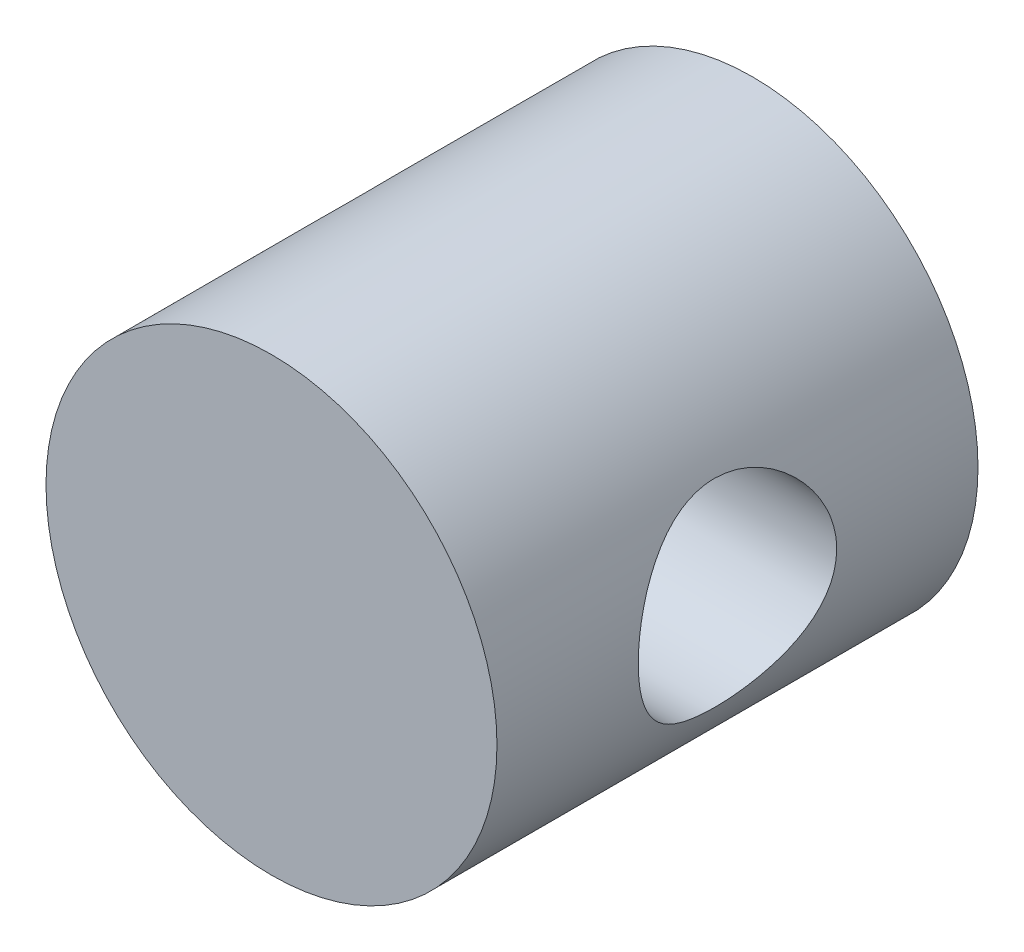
ISO-10303-21;
HEADER;
FILE_DESCRIPTION(('STEP AP214'),'2;1');
FILE_NAME('part.step','',(''),(''),'','','');
FILE_SCHEMA(('AUTOMOTIVE_DESIGN { 1 0 10303 214 1 1 1 1 }'));
ENDSEC;
DATA;
#1=APPLICATION_CONTEXT('core data for automotive mechanical design processes');
#2=APPLICATION_PROTOCOL_DEFINITION('international standard','automotive_design',2000,#1);
#3=PRODUCT_CONTEXT('',#1,'mechanical');
#4=PRODUCT('Part','Part','',(#3));
#5=PRODUCT_RELATED_PRODUCT_CATEGORY('part','',(#4));
#6=PRODUCT_DEFINITION_FORMATION('','',#4);
#7=PRODUCT_DEFINITION_CONTEXT('part definition',#1,'design');
#8=PRODUCT_DEFINITION('design','',#6,#7);
#9=PRODUCT_DEFINITION_SHAPE('','',#8);
#10=(LENGTH_UNIT() NAMED_UNIT(*) SI_UNIT(.MILLI.,.METRE.));
#11=(NAMED_UNIT(*) PLANE_ANGLE_UNIT() SI_UNIT($,.RADIAN.));
#12=(NAMED_UNIT(*) SI_UNIT($,.STERADIAN.) SOLID_ANGLE_UNIT());
#13=UNCERTAINTY_MEASURE_WITH_UNIT(LENGTH_MEASURE(1.E-05),#10,'distance_accuracy_value','');
#14=(GEOMETRIC_REPRESENTATION_CONTEXT(3) GLOBAL_UNCERTAINTY_ASSIGNED_CONTEXT((#13)) GLOBAL_UNIT_ASSIGNED_CONTEXT((#10,
#11,#12)) REPRESENTATION_CONTEXT('',''));
#15=CARTESIAN_POINT('',(0.,0.,0.));
#16=DIRECTION('',(0.,0.,1.));
#17=DIRECTION('',(1.,0.,0.));
#18=AXIS2_PLACEMENT_3D('',#15,#16,#17);
#19=CARTESIAN_POINT('',(-0.8,0.,8.));
#20=DIRECTION('',(-1.,0.,0.));
#21=DIRECTION('',(0.,0.,1.));
#22=AXIS2_PLACEMENT_3D('',#19,#20,#21);
#23=PLANE('',#22);
#24=CARTESIAN_POINT('',(-0.8,0.,8.));
#25=DIRECTION('',(1.,0.,0.));
#26=DIRECTION('',(0.,0.,-1.));
#27=AXIS2_PLACEMENT_3D('',#24,#25,#26);
#28=CIRCLE('',#27,3.3);
#29=CARTESIAN_POINT('',(-0.8,0.,4.7));
#30=VERTEX_POINT('',#29);
#31=EDGE_CURVE('E20',#30,#30,#28,.T.);
#32=ORIENTED_EDGE('',*,*,#31,.T.);
#33=EDGE_LOOP('',(#32));
#34=FACE_BOUND('',#33,.T.);
#35=CARTESIAN_POINT('',(-0.8,0.,8.));
#36=DIRECTION('',(1.,0.,0.));
#37=DIRECTION('',(0.,0.,-1.));
#38=AXIS2_PLACEMENT_3D('',#35,#36,#37);
#39=CIRCLE('',#38,5.5);
#40=CARTESIAN_POINT('',(-0.8,0.,2.5));
#41=VERTEX_POINT('',#40);
#42=EDGE_CURVE('E68',#41,#41,#39,.F.);
#43=ORIENTED_EDGE('',*,*,#42,.T.);
#44=EDGE_LOOP('',(#43));
#45=FACE_BOUND('',#44,.T.);
#46=ADVANCED_FACE('F17',(#34,#45),#23,.T.);
#47=CARTESIAN_POINT('',(0.,0.,16.));
#48=DIRECTION('',(0.,0.,-1.));
#49=DIRECTION('',(-1.,0.,0.));
#50=AXIS2_PLACEMENT_3D('',#47,#48,#49);
#51=PLANE('',#50);
#52=CARTESIAN_POINT('',(0.,0.,16.));
#53=DIRECTION('',(0.,0.,1.));
#54=DIRECTION('',(1.,0.,0.));
#55=AXIS2_PLACEMENT_3D('',#52,#53,#54);
#56=CIRCLE('',#55,7.5);
#57=CARTESIAN_POINT('',(7.5,0.,16.));
#58=VERTEX_POINT('',#57);
#59=EDGE_CURVE('E77',#58,#58,#56,.F.);
#60=ORIENTED_EDGE('',*,*,#59,.F.);
#61=EDGE_LOOP('',(#60));
#62=FACE_BOUND('',#61,.T.);
#63=ADVANCED_FACE('F63',(#62),#51,.F.);
#64=CARTESIAN_POINT('',(-0.8,0.,8.));
#65=DIRECTION('',(1.,0.,0.));
#66=DIRECTION('',(0.,0.,-1.));
#67=AXIS2_PLACEMENT_3D('',#64,#65,#66);
#68=CYLINDRICAL_SURFACE('',#67,3.3);
#69=ORIENTED_EDGE('',*,*,#31,.F.);
#70=EDGE_LOOP('',(#69));
#71=FACE_BOUND('',#70,.T.);
#72=CARTESIAN_POINT('',(6.73498329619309,3.3,8.));
#73=CARTESIAN_POINT('',(6.73498440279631,3.29999887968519,7.91248038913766));
#74=CARTESIAN_POINT('',(6.73669708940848,3.29651093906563,7.82493180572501));
#75=CARTESIAN_POINT('',(6.74347981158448,3.28260987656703,7.65050235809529));
#76=CARTESIAN_POINT('',(6.74855187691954,3.27219256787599,7.56362192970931));
#77=CARTESIAN_POINT('',(6.76860529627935,3.23063593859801,7.3046481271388));
#78=CARTESIAN_POINT('',(6.78842323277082,3.18919227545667,7.13445168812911));
#79=CARTESIAN_POINT('',(6.83824112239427,3.08089697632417,6.80497056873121));
#80=CARTESIAN_POINT('',(6.86819625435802,3.01415703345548,6.64564150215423));
#81=CARTESIAN_POINT('',(6.93483535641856,2.85749677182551,6.34044383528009));
#82=CARTESIAN_POINT('',(6.9715182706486,2.76758008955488,6.19457312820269));
#83=CARTESIAN_POINT('',(7.05033258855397,2.56043465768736,5.91025350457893));
#84=CARTESIAN_POINT('',(7.09266177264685,2.44183979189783,5.77285489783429));
#85=CARTESIAN_POINT('',(7.17638236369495,2.18356607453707,5.51910723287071));
#86=CARTESIAN_POINT('',(7.217773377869,2.04387857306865,5.40276685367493));
#87=CARTESIAN_POINT('',(7.29740541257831,1.73892968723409,5.1888655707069));
#88=CARTESIAN_POINT('',(7.33539015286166,1.57274639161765,5.0925148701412));
#89=CARTESIAN_POINT('',(7.40147240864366,1.22455264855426,4.92959937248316));
#90=CARTESIAN_POINT('',(7.42957479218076,1.0425500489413,4.86301990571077));
#91=CARTESIAN_POINT('',(7.4713182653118,0.678932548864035,4.76543234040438));
#92=CARTESIAN_POINT('',(7.48569505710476,0.497891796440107,4.73260624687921));
#93=CARTESIAN_POINT('',(7.50105934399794,0.132340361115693,4.69755300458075));
#94=CARTESIAN_POINT('',(7.50205293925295,-0.0521687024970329,4.69531191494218));
#95=CARTESIAN_POINT('',(7.49095039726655,-0.40608529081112,4.72060475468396));
#96=CARTESIAN_POINT('',(7.47973618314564,-0.575669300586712,4.74613249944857));
#97=CARTESIAN_POINT('',(7.44672166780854,-0.907858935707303,4.8227599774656));
#98=CARTESIAN_POINT('',(7.42492058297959,-1.07046404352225,4.87386160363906));
#99=CARTESIAN_POINT('',(7.3723904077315,-1.38709453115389,5.00074755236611));
#100=CARTESIAN_POINT('',(7.34153003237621,-1.54095092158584,5.07689696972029));
#101=CARTESIAN_POINT('',(7.27383821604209,-1.83410626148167,5.25133178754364));
#102=CARTESIAN_POINT('',(7.23700460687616,-1.97339989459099,5.34962523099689));
#103=CARTESIAN_POINT('',(7.15764040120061,-2.24492990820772,5.57436597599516));
#104=CARTESIAN_POINT('',(7.11488951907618,-2.37578855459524,5.70240218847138));
#105=CARTESIAN_POINT('',(7.03056481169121,-2.61481479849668,5.97858424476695));
#106=CARTESIAN_POINT('',(6.98899155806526,-2.7229715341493,6.12673965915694));
#107=CARTESIAN_POINT('',(6.91004959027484,-2.91765559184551,6.4463990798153));
#108=CARTESIAN_POINT('',(6.87291678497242,-3.00313982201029,6.61860182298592));
#109=CARTESIAN_POINT('',(6.80995713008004,-3.14331942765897,6.97701908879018));
#110=CARTESIAN_POINT('',(6.78412112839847,-3.19803973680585,7.16322212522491));
#111=CARTESIAN_POINT('',(6.7490291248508,-3.2714154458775,7.53051092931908));
#112=CARTESIAN_POINT('',(6.73874129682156,-3.29232248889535,7.71104602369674));
#113=CARTESIAN_POINT('',(6.73295149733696,-3.30415333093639,8.07329965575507));
#114=CARTESIAN_POINT('',(6.73744334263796,-3.29508966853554,8.25501766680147));
#115=CARTESIAN_POINT('',(6.75963124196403,-3.24929651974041,8.60007664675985));
#116=CARTESIAN_POINT('',(6.77631192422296,-3.21469251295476,8.76377386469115));
#117=CARTESIAN_POINT('',(6.81964575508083,-3.1217051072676,9.08286232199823));
#118=CARTESIAN_POINT('',(6.84630142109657,-3.06331570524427,9.23825145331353));
#119=CARTESIAN_POINT('',(6.90801364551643,-2.92156740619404,9.54405492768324));
#120=CARTESIAN_POINT('',(6.94339078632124,-2.83721454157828,9.69394165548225));
#121=CARTESIAN_POINT('',(7.01815092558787,-2.64688547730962,9.97820308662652));
#122=CARTESIAN_POINT('',(7.05753578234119,-2.54089922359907,10.1125705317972));
#123=CARTESIAN_POINT('',(7.14027712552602,-2.29875282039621,10.3749695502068));
#124=CARTESIAN_POINT('',(7.18366320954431,-2.160705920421,10.5012579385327));
#125=CARTESIAN_POINT('',(7.26618934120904,-1.86443522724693,10.7292524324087));
#126=CARTESIAN_POINT('',(7.30532884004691,-1.70620883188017,10.8309553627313));
#127=CARTESIAN_POINT('',(7.37543116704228,-1.3719865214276,11.0072562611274));
#128=CARTESIAN_POINT('',(7.40633073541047,-1.19586670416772,11.0816460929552));
#129=CARTESIAN_POINT('',(7.45597789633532,-0.831886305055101,11.1991355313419));
#130=CARTESIAN_POINT('',(7.47473364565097,-0.644033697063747,11.2422561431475));
#131=CARTESIAN_POINT('',(7.49694491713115,-0.277404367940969,11.2931217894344));
#132=CARTESIAN_POINT('',(7.5014592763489,-0.0990297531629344,11.3033163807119));
#133=CARTESIAN_POINT('',(7.49771025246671,0.256869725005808,11.2947959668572));
#134=CARTESIAN_POINT('',(7.48944959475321,0.434394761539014,11.2760871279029));
#135=CARTESIAN_POINT('',(7.46166482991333,0.775658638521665,11.2120424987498));
#136=CARTESIAN_POINT('',(7.44263870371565,0.939662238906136,11.1678824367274));
#137=CARTESIAN_POINT('',(7.39552410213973,1.25781917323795,11.0555471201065));
#138=CARTESIAN_POINT('',(7.36743401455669,1.41197074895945,10.987367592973));
#139=CARTESIAN_POINT('',(7.3032587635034,1.71386073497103,10.8254834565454));
#140=CARTESIAN_POINT('',(7.26686624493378,1.86098167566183,10.7307524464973));
#141=CARTESIAN_POINT('',(7.19027928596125,2.13788605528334,10.5198719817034));
#142=CARTESIAN_POINT('',(7.15008326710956,2.26766224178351,10.4037136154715));
#143=CARTESIAN_POINT('',(7.06648160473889,2.5166223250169,10.1428018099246));
#144=CARTESIAN_POINT('',(7.02306730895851,2.63421946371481,9.99653465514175));
#145=CARTESIAN_POINT('',(6.94095472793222,2.84356189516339,9.68502904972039));
#146=CARTESIAN_POINT('',(6.90225933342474,2.93529138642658,9.51977908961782));
#147=CARTESIAN_POINT('',(6.85143163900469,3.05117389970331,9.26069693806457));
#148=CARTESIAN_POINT('',(6.83567083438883,3.08622416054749,9.17230703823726));
#149=CARTESIAN_POINT('',(6.80713016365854,3.14867607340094,8.99241444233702));
#150=CARTESIAN_POINT('',(6.79434880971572,3.17608154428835,8.90091332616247));
#151=CARTESIAN_POINT('',(6.7722849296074,3.22285969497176,8.71573476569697));
#152=CARTESIAN_POINT('',(6.76299321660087,3.2422534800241,8.62206373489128));
#153=CARTESIAN_POINT('',(6.74824138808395,3.2728473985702,8.43314267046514));
#154=CARTESIAN_POINT('',(6.74277837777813,3.28405372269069,8.33789388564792));
#155=CARTESIAN_POINT('',(6.73789118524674,3.29405980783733,8.20200342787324));
#156=CARTESIAN_POINT('',(6.73680179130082,3.29628645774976,8.1616451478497));
#157=CARTESIAN_POINT('',(6.73534758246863,3.29925683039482,8.08085997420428));
#158=CARTESIAN_POINT('',(6.73498278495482,3.30000051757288,8.04043307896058));
#159=CARTESIAN_POINT('',(6.73498329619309,3.3,8.));
#160=B_SPLINE_CURVE_WITH_KNOTS('',3,(#72,#73,#74,#75,#76,#77,#78,#79,#80,#81,#82,#83,#84,#85,
#86,#87,#88,#89,#90,#91,#92,#93,#94,#95,#96,#97,#98,#99,#100,#101,#102,#103,#104,#105,#106,#107,
#108,#109,#110,#111,#112,#113,#114,#115,#116,#117,#118,#119,#120,#121,#122,#123,#124,#125,#126,
#127,#128,#129,#130,#131,#132,#133,#134,#135,#136,#137,#138,#139,#140,#141,#142,#143,#144,#145,
#146,#147,#148,#149,#150,#151,#152,#153,#154,#155,#156,#157,#158,#159),.UNSPECIFIED.,.T.,.F.,(4,
2,2,2,2,2,2,2,2,2,2,2,2,2,2,2,2,2,2,2,2,2,2,2,2,2,2,2,2,2,2,2,2,2,2,2,2,2,2,2,2,2,2,4),(0.,
0.262513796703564,0.525186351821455,1.05121039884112,1.57493839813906,2.09858427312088,
2.6552964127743,3.21223747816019,3.79666539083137,4.38080501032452,4.93150780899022,
5.48195958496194,5.99513293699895,6.50834427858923,7.02939469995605,7.55063467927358,
8.11216447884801,8.67396233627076,9.25832230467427,9.84220797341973,10.3853196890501,
10.9282042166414,11.4303806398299,11.932683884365,12.4573002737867,12.9821610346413,
13.5556963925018,14.1293057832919,14.7071997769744,15.2847052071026,15.8181181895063,
16.3514173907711,16.8618569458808,17.3723873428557,17.9063097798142,18.4404547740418,
19.0157587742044,19.5914134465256,19.8802334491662,20.168908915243,20.4568189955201,
20.7445111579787,20.8657866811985,20.987065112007),.UNSPECIFIED.);
#161=CARTESIAN_POINT('',(6.73498329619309,3.3,8.));
#162=VERTEX_POINT('',#161);
#163=EDGE_CURVE('E33',#162,#162,#160,.T.);
#164=ORIENTED_EDGE('',*,*,#163,.F.);
#165=EDGE_LOOP('',(#164));
#166=FACE_BOUND('',#165,.T.);
#167=ADVANCED_FACE('F58',(#71,#166),#68,.F.);
#168=CARTESIAN_POINT('',(-7.5,0.,8.));
#169=DIRECTION('',(1.,0.,0.));
#170=DIRECTION('',(0.,0.,-1.));
#171=AXIS2_PLACEMENT_3D('',#168,#169,#170);
#172=CYLINDRICAL_SURFACE('',#171,5.5);
#173=ORIENTED_EDGE('',*,*,#42,.F.);
#174=EDGE_LOOP('',(#173));
#175=FACE_BOUND('',#174,.T.);
#176=CARTESIAN_POINT('',(-7.5,0.,13.5));
#177=CARTESIAN_POINT('',(-7.49999948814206,-0.135117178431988,13.4999994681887));
#178=CARTESIAN_POINT('',(-7.49634070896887,-0.270242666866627,13.4950132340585));
#179=CARTESIAN_POINT('',(-7.48179126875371,-0.539425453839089,13.4751480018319));
#180=CARTESIAN_POINT('',(-7.47089732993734,-0.673482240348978,13.4602645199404));
#181=CARTESIAN_POINT('',(-7.44211640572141,-0.939595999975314,13.4208190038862));
#182=CARTESIAN_POINT('',(-7.42421939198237,-1.0716498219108,13.3962430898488));
#183=CARTESIAN_POINT('',(-7.38183795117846,-1.33265173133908,13.3377838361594));
#184=CARTESIAN_POINT('',(-7.35735064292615,-1.46159843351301,13.3038964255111));
#185=CARTESIAN_POINT('',(-7.30249378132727,-1.71471423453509,13.2275345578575));
#186=CARTESIAN_POINT('',(-7.27216201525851,-1.83890819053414,13.1851151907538));
#187=CARTESIAN_POINT('',(-7.20612294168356,-2.08273237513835,13.092079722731));
#188=CARTESIAN_POINT('',(-7.17041351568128,-2.20236078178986,13.0414603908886));
#189=CARTESIAN_POINT('',(-7.05623886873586,-2.55340831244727,12.8781764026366));
#190=CARTESIAN_POINT('',(-6.97066102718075,-2.7772845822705,12.7539951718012));
#191=CARTESIAN_POINT('',(-6.77776052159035,-3.22116319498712,12.4665897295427));
#192=CARTESIAN_POINT('',(-6.6691656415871,-3.4389437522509,12.300835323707));
#193=CARTESIAN_POINT('',(-6.44323996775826,-3.84561656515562,11.9414447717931));
#194=CARTESIAN_POINT('',(-6.32589591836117,-4.03446360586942,11.7477658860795));
#195=CARTESIAN_POINT('',(-6.13800790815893,-4.31168208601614,11.4183790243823));
#196=CARTESIAN_POINT('',(-6.06763479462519,-4.40990335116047,11.2907096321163));
#197=CARTESIAN_POINT('',(-5.92853223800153,-4.59520500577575,11.0265701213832));
#198=CARTESIAN_POINT('',(-5.85980327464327,-4.68228217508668,10.8900974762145));
#199=CARTESIAN_POINT('',(-5.72626200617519,-4.84468435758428,10.6087122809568));
#200=CARTESIAN_POINT('',(-5.66144543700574,-4.92002231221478,10.4638092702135));
#201=CARTESIAN_POINT('',(-5.5382267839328,-5.05832134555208,10.1657325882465));
#202=CARTESIAN_POINT('',(-5.47982111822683,-5.12128935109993,10.0125636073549));
#203=CARTESIAN_POINT('',(-5.35442064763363,-5.25271131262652,9.64573157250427));
#204=CARTESIAN_POINT('',(-5.29101894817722,-5.31603760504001,9.42887693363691));
#205=CARTESIAN_POINT('',(-5.21419214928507,-5.39105508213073,9.09523265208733));
#206=CARTESIAN_POINT('',(-5.19163652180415,-5.4127258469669,8.98268798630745));
#207=CARTESIAN_POINT('',(-5.1534463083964,-5.44910002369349,8.75533927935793));
#208=CARTESIAN_POINT('',(-5.13780834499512,-5.46380683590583,8.64053636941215));
#209=CARTESIAN_POINT('',(-5.11404470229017,-5.48605659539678,8.40850688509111));
#210=CARTESIAN_POINT('',(-5.10598116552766,-5.49354029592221,8.29126819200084));
#211=CARTESIAN_POINT('',(-5.09797816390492,-5.50096806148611,8.05627458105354));
#212=CARTESIAN_POINT('',(-5.0980383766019,-5.50091242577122,7.93851968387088));
#213=CARTESIAN_POINT('',(-5.10628184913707,-5.49326097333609,7.703498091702));
#214=CARTESIAN_POINT('',(-5.11446831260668,-5.48566218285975,7.58623160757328));
#215=CARTESIAN_POINT('',(-5.13857348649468,-5.46308815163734,7.35317133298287));
#216=CARTESIAN_POINT('',(-5.15449609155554,-5.44810919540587,7.23737831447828));
#217=CARTESIAN_POINT('',(-5.19546426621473,-5.40906945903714,6.99575213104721));
#218=CARTESIAN_POINT('',(-5.22130927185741,-5.38420268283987,6.87018491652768));
#219=CARTESIAN_POINT('',(-5.28038638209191,-5.32627762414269,6.62270287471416));
#220=CARTESIAN_POINT('',(-5.31362343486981,-5.29321385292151,6.50079055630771));
#221=CARTESIAN_POINT('',(-5.42250443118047,-5.18238591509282,6.14100013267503));
#222=CARTESIAN_POINT('',(-5.50726807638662,-5.09302977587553,5.90933467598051));
#223=CARTESIAN_POINT('',(-5.66096832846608,-4.92058405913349,5.537227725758));
#224=CARTESIAN_POINT('',(-5.72610792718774,-4.84487977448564,5.3915894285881));
#225=CARTESIAN_POINT('',(-5.86030412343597,-4.68166502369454,5.1088702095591));
#226=CARTESIAN_POINT('',(-5.92936198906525,-4.59415072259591,4.97179208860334));
#227=CARTESIAN_POINT('',(-6.06921163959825,-4.40775079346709,4.70635935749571));
#228=CARTESIAN_POINT('',(-6.14000493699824,-4.30885494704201,4.57801275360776));
#229=CARTESIAN_POINT('',(-6.28133900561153,-4.10008164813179,4.3304581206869));
#230=CARTESIAN_POINT('',(-6.35187980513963,-3.99020546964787,4.21124903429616));
#231=CARTESIAN_POINT('',(-6.49194465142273,-3.75809608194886,3.9808172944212));
#232=CARTESIAN_POINT('',(-6.56144059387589,-3.63571127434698,3.86972998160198));
#233=CARTESIAN_POINT('',(-6.69667373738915,-3.38015676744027,3.65810408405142));
#234=CARTESIAN_POINT('',(-6.7624105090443,-3.24698584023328,3.55756670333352));
#235=CARTESIAN_POINT('',(-6.88834060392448,-2.9704890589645,3.36812858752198));
#236=CARTESIAN_POINT('',(-6.94854267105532,-2.82717987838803,3.27920940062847));
#237=CARTESIAN_POINT('',(-7.06186175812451,-2.53085779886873,3.11394760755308));
#238=CARTESIAN_POINT('',(-7.11498164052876,-2.37784885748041,3.03759991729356));
#239=CARTESIAN_POINT('',(-7.20008302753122,-2.10329897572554,2.91644369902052));
#240=CARTESIAN_POINT('',(-7.23399798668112,-1.98370425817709,2.86856056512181));
#241=CARTESIAN_POINT('',(-7.29640291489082,-1.74019821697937,2.78095392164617));
#242=CARTESIAN_POINT('',(-7.3248940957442,-1.61628786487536,2.74122858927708));
#243=CARTESIAN_POINT('',(-7.37583846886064,-1.36506453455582,2.67049780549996));
#244=CARTESIAN_POINT('',(-7.39830376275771,-1.23775894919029,2.63947487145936));
#245=CARTESIAN_POINT('',(-7.4367877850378,-0.980361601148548,2.58648497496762));
#246=CARTESIAN_POINT('',(-7.45280914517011,-0.850270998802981,2.56451431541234));
#247=CARTESIAN_POINT('',(-7.47688064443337,-0.600422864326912,2.5315580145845));
#248=CARTESIAN_POINT('',(-7.48553472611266,-0.480832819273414,2.51973914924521));
#249=CARTESIAN_POINT('',(-7.49709526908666,-0.240830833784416,2.50395903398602));
#250=CARTESIAN_POINT('',(-7.50000045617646,-0.120418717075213,2.49999952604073));
#251=CARTESIAN_POINT('',(-7.49999948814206,0.135117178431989,2.50000053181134));
#252=CARTESIAN_POINT('',(-7.49634070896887,0.270242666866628,2.50498676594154));
#253=CARTESIAN_POINT('',(-7.48179126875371,0.539425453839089,2.52485199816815));
#254=CARTESIAN_POINT('',(-7.47089732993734,0.673482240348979,2.53973548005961));
#255=CARTESIAN_POINT('',(-7.44211640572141,0.939595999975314,2.57918099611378));
#256=CARTESIAN_POINT('',(-7.42421939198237,1.0716498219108,2.6037569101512));
#257=CARTESIAN_POINT('',(-7.38183795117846,1.33265173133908,2.66221616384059));
#258=CARTESIAN_POINT('',(-7.35735064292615,1.46159843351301,2.69610357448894));
#259=CARTESIAN_POINT('',(-7.30249378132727,1.71471423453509,2.77246544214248));
#260=CARTESIAN_POINT('',(-7.27216201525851,1.83890819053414,2.81488480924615));
#261=CARTESIAN_POINT('',(-7.20612294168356,2.08273237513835,2.90792027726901));
#262=CARTESIAN_POINT('',(-7.17041351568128,2.20236078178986,2.95853960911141));
#263=CARTESIAN_POINT('',(-7.05623886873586,2.55340831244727,3.12182359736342));
#264=CARTESIAN_POINT('',(-6.97066102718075,2.7772845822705,3.24600482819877));
#265=CARTESIAN_POINT('',(-6.77776052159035,3.22116319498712,3.53341027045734));
#266=CARTESIAN_POINT('',(-6.66916564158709,3.4389437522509,3.69916467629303));
#267=CARTESIAN_POINT('',(-6.44323996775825,3.84561656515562,4.05855522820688));
#268=CARTESIAN_POINT('',(-6.32589591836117,4.03446360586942,4.25223411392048));
#269=CARTESIAN_POINT('',(-6.13800790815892,4.31168208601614,4.58162097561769));
#270=CARTESIAN_POINT('',(-6.06763479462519,4.40990335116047,4.70929036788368));
#271=CARTESIAN_POINT('',(-5.92853223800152,4.59520500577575,4.97342987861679));
#272=CARTESIAN_POINT('',(-5.85980327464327,4.68228217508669,5.10990252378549));
#273=CARTESIAN_POINT('',(-5.72626200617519,4.84468435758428,5.39128771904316));
#274=CARTESIAN_POINT('',(-5.66144543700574,4.92002231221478,5.53619072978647));
#275=CARTESIAN_POINT('',(-5.5382267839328,5.05832134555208,5.8342674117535));
#276=CARTESIAN_POINT('',(-5.47982111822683,5.12128935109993,5.98743639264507));
#277=CARTESIAN_POINT('',(-5.35442064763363,5.25271131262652,6.35426842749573));
#278=CARTESIAN_POINT('',(-5.29101894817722,5.31603760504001,6.57112306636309));
#279=CARTESIAN_POINT('',(-5.21419214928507,5.39105508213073,6.90476734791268));
#280=CARTESIAN_POINT('',(-5.19163652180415,5.41272584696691,7.01731201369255));
#281=CARTESIAN_POINT('',(-5.1534463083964,5.4491000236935,7.24466072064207));
#282=CARTESIAN_POINT('',(-5.13780834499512,5.46380683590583,7.35946363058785));
#283=CARTESIAN_POINT('',(-5.11404470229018,5.48605659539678,7.59149311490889));
#284=CARTESIAN_POINT('',(-5.10598116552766,5.49354029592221,7.70873180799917));
#285=CARTESIAN_POINT('',(-5.09797816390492,5.50096806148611,7.94372541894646));
#286=CARTESIAN_POINT('',(-5.0980383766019,5.50091242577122,8.06148031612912));
#287=CARTESIAN_POINT('',(-5.10628184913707,5.49326097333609,8.296501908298));
#288=CARTESIAN_POINT('',(-5.11446831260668,5.48566218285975,8.41376839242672));
#289=CARTESIAN_POINT('',(-5.13857348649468,5.46308815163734,8.64682866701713));
#290=CARTESIAN_POINT('',(-5.15449609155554,5.44810919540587,8.76262168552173));
#291=CARTESIAN_POINT('',(-5.19546426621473,5.40906945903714,9.00424786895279));
#292=CARTESIAN_POINT('',(-5.22130927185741,5.38420268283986,9.12981508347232));
#293=CARTESIAN_POINT('',(-5.28038638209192,5.32627762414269,9.37729712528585));
#294=CARTESIAN_POINT('',(-5.31362343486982,5.29321385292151,9.4992094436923));
#295=CARTESIAN_POINT('',(-5.42250443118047,5.18238591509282,9.85899986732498));
#296=CARTESIAN_POINT('',(-5.50726807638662,5.09302977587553,10.0906653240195));
#297=CARTESIAN_POINT('',(-5.66096832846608,4.92058405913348,10.462772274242));
#298=CARTESIAN_POINT('',(-5.72610792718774,4.84487977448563,10.6084105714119));
#299=CARTESIAN_POINT('',(-5.86030412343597,4.68166502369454,10.8911297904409));
#300=CARTESIAN_POINT('',(-5.92936198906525,4.59415072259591,11.0282079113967));
#301=CARTESIAN_POINT('',(-6.06921163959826,4.40775079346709,11.2936406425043));
#302=CARTESIAN_POINT('',(-6.14000493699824,4.30885494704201,11.4219872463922));
#303=CARTESIAN_POINT('',(-6.28133900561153,4.10008164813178,11.6695418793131));
#304=CARTESIAN_POINT('',(-6.35187980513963,3.99020546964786,11.7887509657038));
#305=CARTESIAN_POINT('',(-6.49194465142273,3.75809608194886,12.0191827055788));
#306=CARTESIAN_POINT('',(-6.56144059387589,3.63571127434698,12.130270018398));
#307=CARTESIAN_POINT('',(-6.69667373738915,3.38015676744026,12.3418959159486));
#308=CARTESIAN_POINT('',(-6.7624105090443,3.24698584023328,12.4424332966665));
#309=CARTESIAN_POINT('',(-6.88834060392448,2.9704890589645,12.631871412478));
#310=CARTESIAN_POINT('',(-6.94854267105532,2.82717987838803,12.7207905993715));
#311=CARTESIAN_POINT('',(-7.06186175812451,2.53085779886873,12.8860523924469));
#312=CARTESIAN_POINT('',(-7.11498164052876,2.37784885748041,12.9624000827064));
#313=CARTESIAN_POINT('',(-7.20008302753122,2.10329897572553,13.0835563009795));
#314=CARTESIAN_POINT('',(-7.23399798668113,1.98370425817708,13.1314394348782));
#315=CARTESIAN_POINT('',(-7.29640291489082,1.74019821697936,13.2190460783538));
#316=CARTESIAN_POINT('',(-7.3248940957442,1.61628786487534,13.2587714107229));
#317=CARTESIAN_POINT('',(-7.37583846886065,1.36506453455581,13.3295021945));
#318=CARTESIAN_POINT('',(-7.39830376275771,1.23775894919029,13.3605251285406));
#319=CARTESIAN_POINT('',(-7.4367877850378,0.980361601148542,13.4135150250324));
#320=CARTESIAN_POINT('',(-7.45280914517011,0.850270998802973,13.4354856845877));
#321=CARTESIAN_POINT('',(-7.47688064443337,0.600422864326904,13.4684419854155));
#322=CARTESIAN_POINT('',(-7.48553472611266,0.480832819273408,13.4802608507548));
#323=CARTESIAN_POINT('',(-7.49709526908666,0.240830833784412,13.496040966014));
#324=CARTESIAN_POINT('',(-7.50000045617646,0.120418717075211,13.5000004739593));
#325=CARTESIAN_POINT('',(-7.5,0.,13.5));
#326=B_SPLINE_CURVE_WITH_KNOTS('',3,(#176,#177,#178,#179,#180,#181,#182,#183,#184,#185,#186,
#187,#188,#189,#190,#191,#192,#193,#194,#195,#196,#197,#198,#199,#200,#201,#202,#203,#204,#205,
#206,#207,#208,#209,#210,#211,#212,#213,#214,#215,#216,#217,#218,#219,#220,#221,#222,#223,#224,
#225,#226,#227,#228,#229,#230,#231,#232,#233,#234,#235,#236,#237,#238,#239,#240,#241,#242,#243,
#244,#245,#246,#247,#248,#249,#250,#251,#252,#253,#254,#255,#256,#257,#258,#259,#260,#261,#262,
#263,#264,#265,#266,#267,#268,#269,#270,#271,#272,#273,#274,#275,#276,#277,#278,#279,#280,#281,
#282,#283,#284,#285,#286,#287,#288,#289,#290,#291,#292,#293,#294,#295,#296,#297,#298,#299,#300,
#301,#302,#303,#304,#305,#306,#307,#308,#309,#310,#311,#312,#313,#314,#315,#316,#317,#318,#319,
#320,#321,#322,#323,#324,#325),.UNSPECIFIED.,.T.,.F.,(4,2,2,2,2,2,2,2,2,2,2,2,2,2,2,2,2,2,2,2,2,
2,2,2,2,2,2,2,2,2,2,2,2,2,2,2,2,2,2,2,2,2,2,2,2,2,2,2,2,2,2,2,2,2,2,2,2,2,2,2,2,2,2,2,2,2,2,2,2,
2,2,2,2,2,4),(0.,0.405225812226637,0.81063533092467,1.21662752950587,1.62279751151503,
2.02642455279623,2.43021101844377,3.23684793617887,4.11716563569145,4.99884529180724,
5.5256967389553,6.05270008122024,6.57911827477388,7.10524084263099,7.80615791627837,
8.15623385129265,8.50613867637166,8.85888976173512,9.2116268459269,9.56450304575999,
9.91755708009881,10.3087333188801,10.700172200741,11.4838630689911,12.0131013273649,
12.5425118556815,13.0724014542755,13.6022296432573,14.1394831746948,14.6767979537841,
15.213248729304,15.7494820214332,16.148732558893,16.5478937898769,16.9462472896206,
17.3444379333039,17.7055020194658,18.0666461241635,18.4718719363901,18.8772814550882,
19.2832736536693,19.6894436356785,20.0930706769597,20.4968571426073,21.3034940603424,
22.1838117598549,23.0654914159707,23.5923428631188,24.1193462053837,24.6457643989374,
25.1718869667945,25.8728040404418,26.2228799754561,26.5727848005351,26.9255358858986,
27.2782729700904,27.6311491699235,27.9842032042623,28.3753794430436,28.7668183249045,
29.5505091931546,30.0797474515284,30.6091579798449,31.139047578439,31.6688757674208,
32.2061292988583,32.7434440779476,33.2798948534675,33.8161281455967,34.2153786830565,
34.6145399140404,35.0128934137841,35.4110840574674,35.7721481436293,36.133292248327),.UNSPECIFIED.);
#327=CARTESIAN_POINT('',(-7.5,0.,13.5));
#328=VERTEX_POINT('',#327);
#329=EDGE_CURVE('E25',#328,#328,#326,.T.);
#330=ORIENTED_EDGE('',*,*,#329,.F.);
#331=EDGE_LOOP('',(#330));
#332=FACE_BOUND('',#331,.T.);
#333=ADVANCED_FACE('F44',(#175,#332),#172,.F.);
#334=CARTESIAN_POINT('',(0.,0.,0.));
#335=DIRECTION('',(0.,0.,-1.));
#336=DIRECTION('',(-1.,0.,0.));
#337=AXIS2_PLACEMENT_3D('',#334,#335,#336);
#338=PLANE('',#337);
#339=CARTESIAN_POINT('',(0.,0.,0.));
#340=DIRECTION('',(0.,0.,1.));
#341=DIRECTION('',(1.,0.,0.));
#342=AXIS2_PLACEMENT_3D('',#339,#340,#341);
#343=CIRCLE('',#342,7.5);
#344=CARTESIAN_POINT('',(7.5,0.,0.));
#345=VERTEX_POINT('',#344);
#346=EDGE_CURVE('E10',#345,#345,#343,.T.);
#347=ORIENTED_EDGE('',*,*,#346,.F.);
#348=EDGE_LOOP('',(#347));
#349=FACE_BOUND('',#348,.T.);
#350=ADVANCED_FACE('F50',(#349),#338,.T.);
#351=CARTESIAN_POINT('',(0.,0.,0.));
#352=DIRECTION('',(0.,0.,1.));
#353=DIRECTION('',(1.,0.,0.));
#354=AXIS2_PLACEMENT_3D('',#351,#352,#353);
#355=CYLINDRICAL_SURFACE('',#354,7.5);
#356=ORIENTED_EDGE('',*,*,#346,.T.);
#357=EDGE_LOOP('',(#356));
#358=FACE_BOUND('',#357,.T.);
#359=ORIENTED_EDGE('',*,*,#329,.T.);
#360=EDGE_LOOP('',(#359));
#361=FACE_BOUND('',#360,.T.);
#362=ORIENTED_EDGE('',*,*,#163,.T.);
#363=EDGE_LOOP('',(#362));
#364=FACE_BOUND('',#363,.T.);
#365=ORIENTED_EDGE('',*,*,#59,.T.);
#366=EDGE_LOOP('',(#365));
#367=FACE_BOUND('',#366,.T.);
#368=ADVANCED_FACE('F47',(#358,#361,#364,#367),#355,.T.);
#369=CLOSED_SHELL('',(#46,#63,#167,#333,#350,#368));
#370=MANIFOLD_SOLID_BREP('B1',#369);
#371=ADVANCED_BREP_SHAPE_REPRESENTATION('',(#18,#370),#14);
#372=SHAPE_DEFINITION_REPRESENTATION(#9,#371);
ENDSEC;
END-ISO-10303-21;
